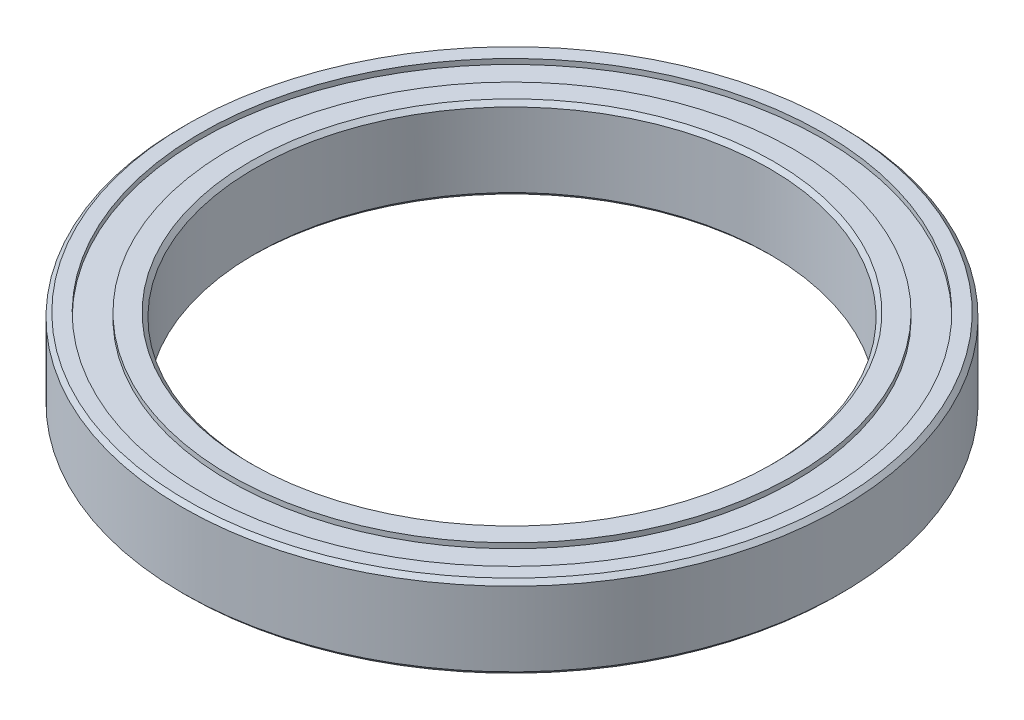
from build123d import *

# Parameters (mm, degrees)
FASE1_SIZE = 0.2


with BuildPart() as part:
    # Skizze2 → Rotation2 (revolve)
    with BuildSketch(Plane(origin=(0, 0, 0), x_dir=(0, 0, -1), z_dir=(1, 0, 0)), mode=Mode.PRIVATE) as rotation2_sk:
        Polygon((-16, 2), (-16, -2), (-15.1, -2), (-15.1, -1.75), (-13.7, -1.75), (-13.7, -2), (-12.5, -2), (-12.5, 2), (-13.7, 2), (-13.7, 1.75), (-15.1, 1.75), (-15.1, 2), align=None)
    revolve(rotation2_sk.sketch.rotate(Axis((0, -18.122913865, 0), (0, 1, 0)), 180), axis=Axis((0, -18.122913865, 0), (0, 1, 0)))

    # Fase1
    fase1_edges = [part.edges().sort_by_distance(p)[0] for p in [
        (0, 2, 12.5),
        (0, -2, 12.5),
        (0, -2, 16),
        (0, 2, 16),
    ]]
    chamfer(fase1_edges, length=FASE1_SIZE)


solid = part.part
